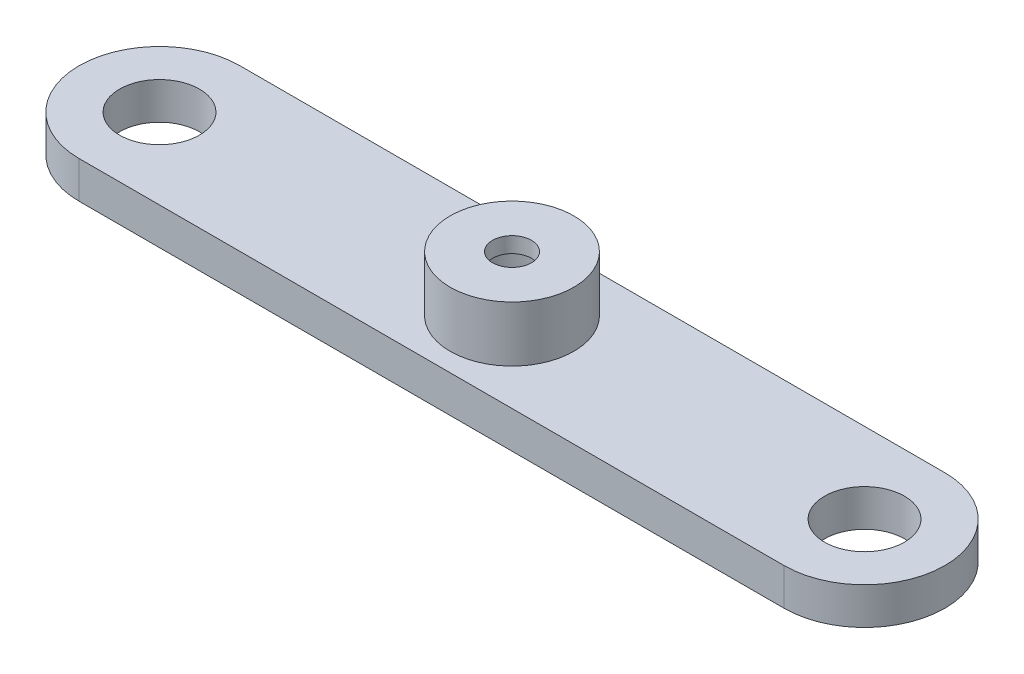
from build123d import *

# Parameters (mm, degrees)
SKETCH1_R           = 3.175
SKETCH1_R_2         = 2.44856
BOSS_EXTRUDE1_DEPTH = 3.95
SKETCH6_R           = 3.175
SKETCH6_R_2         = 0.999998
BOSS_EXTRUDE3_DEPTH = 0.8
SKETCH7_R           = 3.175
SKETCH7_R_2         = 2.05
BOSS_EXTRUDE4_DEPTH = 1.9


with BuildPart() as part:
    # Sketch1 → Boss-Extrude1 (new body)
    with BuildSketch(Plane(origin=(0, 0, 0), x_dir=(1, 0, 0), z_dir=(0, 1, 0))):
        with Locations(Location((0, 0, 0), (0, 0, 270))):
            Circle(SKETCH1_R)
        with Locations(Location((0, 0, 0), (0, 0, 270))):
            Circle(SKETCH1_R_2, mode=Mode.SUBTRACT)
    extrude(amount=BOSS_EXTRUDE1_DEPTH)

    # Sketch6 → Boss-Extrude3 (add)
    with BuildSketch(Plane(origin=(0, 3.95, 0), x_dir=(1, 0, 0), z_dir=(0, 1, 0))):
        with Locations(Location((0, 0, 0), (0, 0, 270))):
            Circle(SKETCH6_R)
        with Locations(Location((0, 0, 0), (0, 0, 270))):
            Circle(SKETCH6_R_2, mode=Mode.SUBTRACT)
    extrude(amount=BOSS_EXTRUDE3_DEPTH)

    # Sketch7 → Boss-Extrude4 (add)
    with BuildSketch(Plane(origin=(0, 0, 0), x_dir=(1, 0, 0), z_dir=(0, 1, 0))):
        with BuildLine():
            Line((18.0975, -4.1275), (-18.0975, -4.1275))
            ThreePointArc((-18.0975, -4.1275), (-22.225, 0), (-18.0975, 4.1275))
            Line((-18.0975, 4.1275), (18.0975, 4.1275))
            ThreePointArc((18.0975, 4.1275), (22.225, 0), (18.0975, -4.1275))
        make_face()
        with Locations(Location((0, 0, 0), (0, 0, 270))):
            Circle(SKETCH7_R, mode=Mode.SUBTRACT)
        with Locations(Location((-18.0975, 0, 0), (0, 0, 90))):
            Circle(SKETCH7_R_2, mode=Mode.SUBTRACT)
        with Locations(Location((18.0975, 0, 0), (0, 0, 90))):
            Circle(SKETCH7_R_2, mode=Mode.SUBTRACT)
    extrude(amount=BOSS_EXTRUDE4_DEPTH)


solid = part.part
